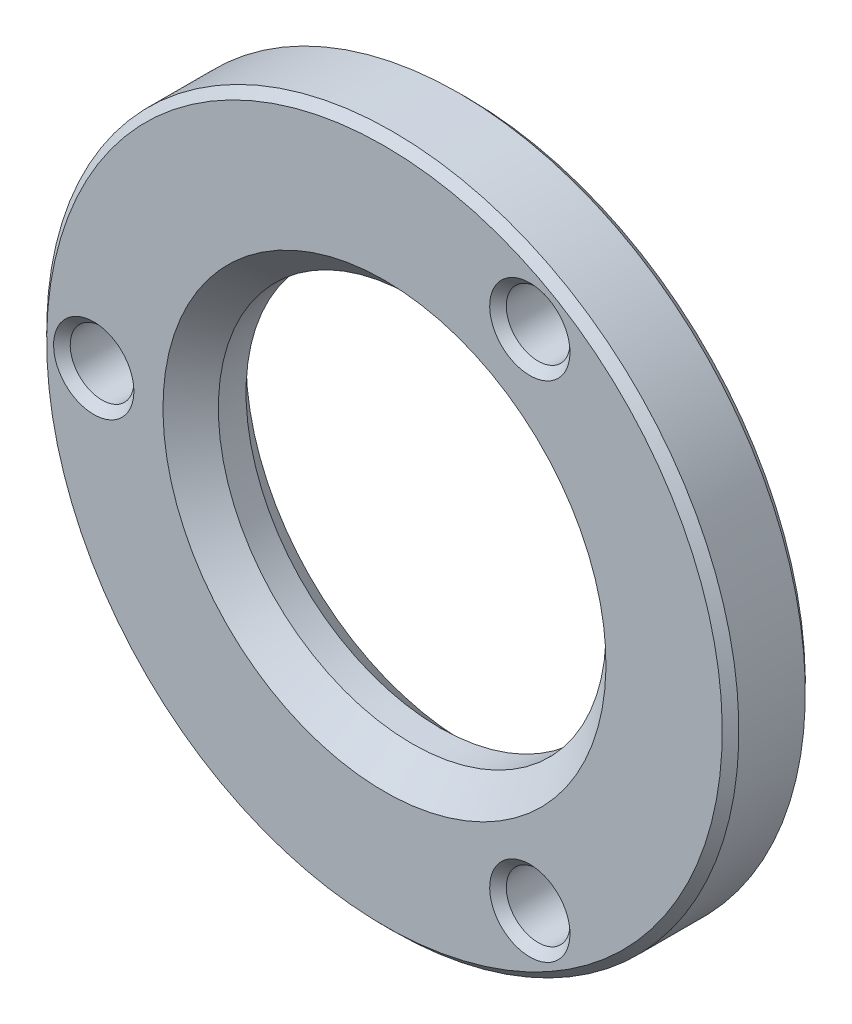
ISO-10303-21;
HEADER;
FILE_DESCRIPTION(('STEP AP214'),'2;1');
FILE_NAME('part.step','',(''),(''),'','','');
FILE_SCHEMA(('AUTOMOTIVE_DESIGN { 1 0 10303 214 1 1 1 1 }'));
ENDSEC;
DATA;
#1=APPLICATION_CONTEXT('core data for automotive mechanical design processes');
#2=APPLICATION_PROTOCOL_DEFINITION('international standard','automotive_design',2000,#1);
#3=PRODUCT_CONTEXT('',#1,'mechanical');
#4=PRODUCT('Part','Part','',(#3));
#5=PRODUCT_RELATED_PRODUCT_CATEGORY('part','',(#4));
#6=PRODUCT_DEFINITION_FORMATION('','',#4);
#7=PRODUCT_DEFINITION_CONTEXT('part definition',#1,'design');
#8=PRODUCT_DEFINITION('design','',#6,#7);
#9=PRODUCT_DEFINITION_SHAPE('','',#8);
#10=(LENGTH_UNIT() NAMED_UNIT(*) SI_UNIT(.MILLI.,.METRE.));
#11=(NAMED_UNIT(*) PLANE_ANGLE_UNIT() SI_UNIT($,.RADIAN.));
#12=(NAMED_UNIT(*) SI_UNIT($,.STERADIAN.) SOLID_ANGLE_UNIT());
#13=UNCERTAINTY_MEASURE_WITH_UNIT(LENGTH_MEASURE(1.E-05),#10,'distance_accuracy_value','');
#14=(GEOMETRIC_REPRESENTATION_CONTEXT(3) GLOBAL_UNCERTAINTY_ASSIGNED_CONTEXT((#13)) GLOBAL_UNIT_ASSIGNED_CONTEXT((#10,
#11,#12)) REPRESENTATION_CONTEXT('',''));
#15=CARTESIAN_POINT('',(0.,0.,0.));
#16=DIRECTION('',(0.,0.,1.));
#17=DIRECTION('',(1.,0.,0.));
#18=AXIS2_PLACEMENT_3D('',#15,#16,#17);
#19=CARTESIAN_POINT('',(0.,0.,3.));
#20=DIRECTION('',(0.,0.,1.));
#21=DIRECTION('',(0.,1.,0.));
#22=AXIS2_PLACEMENT_3D('',#19,#20,#21);
#23=PLANE('',#22);
#24=CARTESIAN_POINT('',(0.,0.,3.));
#25=DIRECTION('',(0.,0.,1.));
#26=DIRECTION('',(0.,1.,0.));
#27=AXIS2_PLACEMENT_3D('',#24,#25,#26);
#28=CIRCLE('',#27,8.);
#29=CARTESIAN_POINT('',(0.,8.,3.));
#30=VERTEX_POINT('',#29);
#31=EDGE_CURVE('E8',#30,#30,#28,.F.);
#32=ORIENTED_EDGE('',*,*,#31,.T.);
#33=EDGE_LOOP('',(#32));
#34=FACE_BOUND('',#33,.T.);
#35=CARTESIAN_POINT('',(5.25,9.09326673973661,3.));
#36=DIRECTION('',(0.,0.,1.));
#37=DIRECTION('',(0.,1.,0.));
#38=AXIS2_PLACEMENT_3D('',#35,#36,#37);
#39=CIRCLE('',#38,1.45);
#40=CARTESIAN_POINT('',(5.25,10.5432667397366,3.));
#41=VERTEX_POINT('',#40);
#42=EDGE_CURVE('E62',#41,#41,#39,.F.);
#43=ORIENTED_EDGE('',*,*,#42,.T.);
#44=EDGE_LOOP('',(#43));
#45=FACE_BOUND('',#44,.T.);
#46=CARTESIAN_POINT('',(-10.5,0.,3.));
#47=DIRECTION('',(0.,0.,1.));
#48=DIRECTION('',(0.,1.,0.));
#49=AXIS2_PLACEMENT_3D('',#46,#47,#48);
#50=CIRCLE('',#49,1.45);
#51=CARTESIAN_POINT('',(-10.5,1.45,3.));
#52=VERTEX_POINT('',#51);
#53=EDGE_CURVE('E65',#52,#52,#50,.F.);
#54=ORIENTED_EDGE('',*,*,#53,.T.);
#55=EDGE_LOOP('',(#54));
#56=FACE_BOUND('',#55,.T.);
#57=CARTESIAN_POINT('',(5.25,-9.0932667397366,3.));
#58=DIRECTION('',(0.,0.,1.));
#59=DIRECTION('',(0.,1.,0.));
#60=AXIS2_PLACEMENT_3D('',#57,#58,#59);
#61=CIRCLE('',#60,1.45);
#62=CARTESIAN_POINT('',(5.25,-7.6432667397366,3.));
#63=VERTEX_POINT('',#62);
#64=EDGE_CURVE('E68',#63,#63,#61,.F.);
#65=ORIENTED_EDGE('',*,*,#64,.T.);
#66=EDGE_LOOP('',(#65));
#67=FACE_BOUND('',#66,.T.);
#68=CARTESIAN_POINT('',(0.,0.,3.));
#69=DIRECTION('',(0.,0.,1.));
#70=DIRECTION('',(0.,1.,0.));
#71=AXIS2_PLACEMENT_3D('',#68,#69,#70);
#72=CIRCLE('',#71,12.2);
#73=CARTESIAN_POINT('',(0.,12.2,3.));
#74=VERTEX_POINT('',#73);
#75=EDGE_CURVE('E71',#74,#74,#72,.T.);
#76=ORIENTED_EDGE('',*,*,#75,.T.);
#77=EDGE_LOOP('',(#76));
#78=FACE_BOUND('',#77,.T.);
#79=ADVANCED_FACE('F12',(#34,#45,#56,#67,#78),#23,.T.);
#80=CARTESIAN_POINT('',(0.,0.,0.));
#81=DIRECTION('',(0.,0.,1.));
#82=DIRECTION('',(0.,1.,0.));
#83=AXIS2_PLACEMENT_3D('',#80,#81,#82);
#84=PLANE('',#83);
#85=CARTESIAN_POINT('',(0.,0.,0.));
#86=DIRECTION('',(0.,0.,1.));
#87=DIRECTION('',(0.,1.,0.));
#88=AXIS2_PLACEMENT_3D('',#85,#86,#87);
#89=CIRCLE('',#88,8.);
#90=CARTESIAN_POINT('',(0.,8.,0.));
#91=VERTEX_POINT('',#90);
#92=EDGE_CURVE('E27',#91,#91,#89,.T.);
#93=ORIENTED_EDGE('',*,*,#92,.T.);
#94=EDGE_LOOP('',(#93));
#95=FACE_BOUND('',#94,.T.);
#96=CARTESIAN_POINT('',(5.25,9.09326673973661,0.));
#97=DIRECTION('',(0.,0.,1.));
#98=DIRECTION('',(0.,1.,0.));
#99=AXIS2_PLACEMENT_3D('',#96,#97,#98);
#100=CIRCLE('',#99,1.45);
#101=CARTESIAN_POINT('',(5.25,10.5432667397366,0.));
#102=VERTEX_POINT('',#101);
#103=EDGE_CURVE('E50',#102,#102,#100,.T.);
#104=ORIENTED_EDGE('',*,*,#103,.T.);
#105=EDGE_LOOP('',(#104));
#106=FACE_BOUND('',#105,.T.);
#107=CARTESIAN_POINT('',(-10.5,0.,0.));
#108=DIRECTION('',(0.,0.,1.));
#109=DIRECTION('',(0.,1.,0.));
#110=AXIS2_PLACEMENT_3D('',#107,#108,#109);
#111=CIRCLE('',#110,1.45);
#112=CARTESIAN_POINT('',(-10.5,1.45,0.));
#113=VERTEX_POINT('',#112);
#114=EDGE_CURVE('E53',#113,#113,#111,.T.);
#115=ORIENTED_EDGE('',*,*,#114,.T.);
#116=EDGE_LOOP('',(#115));
#117=FACE_BOUND('',#116,.T.);
#118=CARTESIAN_POINT('',(5.25,-9.0932667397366,0.));
#119=DIRECTION('',(0.,0.,1.));
#120=DIRECTION('',(0.,1.,0.));
#121=AXIS2_PLACEMENT_3D('',#118,#119,#120);
#122=CIRCLE('',#121,1.45);
#123=CARTESIAN_POINT('',(5.25,-7.6432667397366,0.));
#124=VERTEX_POINT('',#123);
#125=EDGE_CURVE('E56',#124,#124,#122,.T.);
#126=ORIENTED_EDGE('',*,*,#125,.T.);
#127=EDGE_LOOP('',(#126));
#128=FACE_BOUND('',#127,.T.);
#129=CARTESIAN_POINT('',(0.,0.,0.));
#130=DIRECTION('',(0.,0.,1.));
#131=DIRECTION('',(0.,1.,0.));
#132=AXIS2_PLACEMENT_3D('',#129,#130,#131);
#133=CIRCLE('',#132,12.2);
#134=CARTESIAN_POINT('',(0.,12.2,0.));
#135=VERTEX_POINT('',#134);
#136=EDGE_CURVE('E59',#135,#135,#133,.F.);
#137=ORIENTED_EDGE('',*,*,#136,.T.);
#138=EDGE_LOOP('',(#137));
#139=FACE_BOUND('',#138,.T.);
#140=ADVANCED_FACE('F91',(#95,#106,#117,#128,#139),#84,.F.);
#141=CARTESIAN_POINT('',(0.,0.,3.));
#142=DIRECTION('',(0.,0.,-1.));
#143=DIRECTION('',(0.,-1.,0.));
#144=AXIS2_PLACEMENT_3D('',#141,#142,#143);
#145=CYLINDRICAL_SURFACE('',#144,12.5);
#146=CARTESIAN_POINT('',(0.,0.,0.3));
#147=DIRECTION('',(0.,0.,1.));
#148=DIRECTION('',(0.,1.,0.));
#149=AXIS2_PLACEMENT_3D('',#146,#147,#148);
#150=CIRCLE('',#149,12.5);
#151=CARTESIAN_POINT('',(0.,12.5,0.3));
#152=VERTEX_POINT('',#151);
#153=EDGE_CURVE('E32',#152,#152,#150,.T.);
#154=ORIENTED_EDGE('',*,*,#153,.T.);
#155=EDGE_LOOP('',(#154));
#156=FACE_BOUND('',#155,.T.);
#157=CARTESIAN_POINT('',(0.,0.,2.7));
#158=DIRECTION('',(0.,0.,1.));
#159=DIRECTION('',(0.,1.,0.));
#160=AXIS2_PLACEMENT_3D('',#157,#158,#159);
#161=CIRCLE('',#160,12.5);
#162=CARTESIAN_POINT('',(0.,12.5,2.7));
#163=VERTEX_POINT('',#162);
#164=EDGE_CURVE('E35',#163,#163,#161,.F.);
#165=ORIENTED_EDGE('',*,*,#164,.T.);
#166=EDGE_LOOP('',(#165));
#167=FACE_BOUND('',#166,.T.);
#168=ADVANCED_FACE('F94',(#156,#167),#145,.T.);
#169=CARTESIAN_POINT('',(0.,0.,3.));
#170=DIRECTION('',(0.,0.,-1.));
#171=DIRECTION('',(0.,-1.,0.));
#172=AXIS2_PLACEMENT_3D('',#169,#170,#171);
#173=CYLINDRICAL_SURFACE('',#172,7.);
#174=CARTESIAN_POINT('',(0.,0.,1.));
#175=DIRECTION('',(0.,0.,1.));
#176=DIRECTION('',(0.,1.,0.));
#177=AXIS2_PLACEMENT_3D('',#174,#175,#176);
#178=CIRCLE('',#177,7.);
#179=CARTESIAN_POINT('',(0.,7.,1.));
#180=VERTEX_POINT('',#179);
#181=EDGE_CURVE('E19',#180,#180,#178,.F.);
#182=ORIENTED_EDGE('',*,*,#181,.T.);
#183=EDGE_LOOP('',(#182));
#184=FACE_BOUND('',#183,.T.);
#185=CARTESIAN_POINT('',(0.,0.,2.));
#186=DIRECTION('',(0.,0.,1.));
#187=DIRECTION('',(0.,1.,0.));
#188=AXIS2_PLACEMENT_3D('',#185,#186,#187);
#189=CIRCLE('',#188,7.);
#190=CARTESIAN_POINT('',(0.,7.,2.));
#191=VERTEX_POINT('',#190);
#192=EDGE_CURVE('E23',#191,#191,#189,.T.);
#193=ORIENTED_EDGE('',*,*,#192,.T.);
#194=EDGE_LOOP('',(#193));
#195=FACE_BOUND('',#194,.T.);
#196=ADVANCED_FACE('F113',(#184,#195),#173,.F.);
#197=CARTESIAN_POINT('',(-10.5,0.,0.));
#198=DIRECTION('',(0.,0.,1.));
#199=DIRECTION('',(0.,1.,0.));
#200=AXIS2_PLACEMENT_3D('',#197,#198,#199);
#201=CYLINDRICAL_SURFACE('',#200,1.15);
#202=CARTESIAN_POINT('',(-10.5,0.,2.7));
#203=DIRECTION('',(0.,0.,1.));
#204=DIRECTION('',(0.,1.,0.));
#205=AXIS2_PLACEMENT_3D('',#202,#203,#204);
#206=CIRCLE('',#205,1.15);
#207=CARTESIAN_POINT('',(-10.5,1.15,2.7));
#208=VERTEX_POINT('',#207);
#209=EDGE_CURVE('E44',#208,#208,#206,.T.);
#210=ORIENTED_EDGE('',*,*,#209,.T.);
#211=EDGE_LOOP('',(#210));
#212=FACE_BOUND('',#211,.T.);
#213=CARTESIAN_POINT('',(-10.5,0.,0.3));
#214=DIRECTION('',(0.,0.,1.));
#215=DIRECTION('',(0.,1.,0.));
#216=AXIS2_PLACEMENT_3D('',#213,#214,#215);
#217=CIRCLE('',#216,1.15);
#218=CARTESIAN_POINT('',(-10.5,1.15,0.3));
#219=VERTEX_POINT('',#218);
#220=EDGE_CURVE('E47',#219,#219,#217,.F.);
#221=ORIENTED_EDGE('',*,*,#220,.T.);
#222=EDGE_LOOP('',(#221));
#223=FACE_BOUND('',#222,.T.);
#224=ADVANCED_FACE('F162',(#212,#223),#201,.F.);
#225=CARTESIAN_POINT('',(5.25,-9.0932667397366,0.));
#226=DIRECTION('',(0.,0.,1.));
#227=DIRECTION('',(0.,1.,0.));
#228=AXIS2_PLACEMENT_3D('',#225,#226,#227);
#229=CYLINDRICAL_SURFACE('',#228,1.15);
#230=CARTESIAN_POINT('',(5.25,-9.0932667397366,2.7));
#231=DIRECTION('',(0.,0.,1.));
#232=DIRECTION('',(0.,1.,0.));
#233=AXIS2_PLACEMENT_3D('',#230,#231,#232);
#234=CIRCLE('',#233,1.15);
#235=CARTESIAN_POINT('',(5.25,-7.9432667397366,2.7));
#236=VERTEX_POINT('',#235);
#237=EDGE_CURVE('E38',#236,#236,#234,.T.);
#238=ORIENTED_EDGE('',*,*,#237,.T.);
#239=EDGE_LOOP('',(#238));
#240=FACE_BOUND('',#239,.T.);
#241=CARTESIAN_POINT('',(5.25,-9.0932667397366,0.3));
#242=DIRECTION('',(0.,0.,1.));
#243=DIRECTION('',(0.,1.,0.));
#244=AXIS2_PLACEMENT_3D('',#241,#242,#243);
#245=CIRCLE('',#244,1.15);
#246=CARTESIAN_POINT('',(5.25,-7.9432667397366,0.3));
#247=VERTEX_POINT('',#246);
#248=EDGE_CURVE('E41',#247,#247,#245,.F.);
#249=ORIENTED_EDGE('',*,*,#248,.T.);
#250=EDGE_LOOP('',(#249));
#251=FACE_BOUND('',#250,.T.);
#252=ADVANCED_FACE('F166',(#240,#251),#229,.F.);
#253=CARTESIAN_POINT('',(5.25,9.09326673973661,0.));
#254=DIRECTION('',(0.,0.,1.));
#255=DIRECTION('',(0.,1.,0.));
#256=AXIS2_PLACEMENT_3D('',#253,#254,#255);
#257=CYLINDRICAL_SURFACE('',#256,1.15);
#258=CARTESIAN_POINT('',(5.25,9.09326673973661,2.7));
#259=DIRECTION('',(0.,0.,1.));
#260=DIRECTION('',(0.,1.,0.));
#261=AXIS2_PLACEMENT_3D('',#258,#259,#260);
#262=CIRCLE('',#261,1.15);
#263=CARTESIAN_POINT('',(5.25,10.2432667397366,2.7));
#264=VERTEX_POINT('',#263);
#265=EDGE_CURVE('E74',#264,#264,#262,.T.);
#266=ORIENTED_EDGE('',*,*,#265,.T.);
#267=EDGE_LOOP('',(#266));
#268=FACE_BOUND('',#267,.T.);
#269=CARTESIAN_POINT('',(5.25,9.09326673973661,0.3));
#270=DIRECTION('',(0.,0.,1.));
#271=DIRECTION('',(0.,1.,0.));
#272=AXIS2_PLACEMENT_3D('',#269,#270,#271);
#273=CIRCLE('',#272,1.15);
#274=CARTESIAN_POINT('',(5.25,10.2432667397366,0.3));
#275=VERTEX_POINT('',#274);
#276=EDGE_CURVE('E77',#275,#275,#273,.F.);
#277=ORIENTED_EDGE('',*,*,#276,.T.);
#278=EDGE_LOOP('',(#277));
#279=FACE_BOUND('',#278,.T.);
#280=ADVANCED_FACE('F81',(#268,#279),#257,.F.);
#281=CARTESIAN_POINT('',(5.25,9.09326673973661,2.7));
#282=DIRECTION('',(0.,0.,1.));
#283=DIRECTION('',(0.,1.,0.));
#284=AXIS2_PLACEMENT_3D('',#281,#282,#283);
#285=CONICAL_SURFACE('',#284,1.15,0.78539816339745);
#286=ORIENTED_EDGE('',*,*,#42,.F.);
#287=EDGE_LOOP('',(#286));
#288=FACE_BOUND('',#287,.T.);
#289=ORIENTED_EDGE('',*,*,#265,.F.);
#290=EDGE_LOOP('',(#289));
#291=FACE_BOUND('',#290,.T.);
#292=ADVANCED_FACE('F87',(#288,#291),#285,.F.);
#293=CARTESIAN_POINT('',(5.25,9.09326673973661,0.));
#294=DIRECTION('',(0.,0.,-1.));
#295=DIRECTION('',(0.,-1.,0.));
#296=AXIS2_PLACEMENT_3D('',#293,#294,#295);
#297=CONICAL_SURFACE('',#296,1.45,0.785398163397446);
#298=ORIENTED_EDGE('',*,*,#276,.F.);
#299=EDGE_LOOP('',(#298));
#300=FACE_BOUND('',#299,.T.);
#301=ORIENTED_EDGE('',*,*,#103,.F.);
#302=EDGE_LOOP('',(#301));
#303=FACE_BOUND('',#302,.T.);
#304=ADVANCED_FACE('F83',(#300,#303),#297,.F.);
#305=CARTESIAN_POINT('',(-10.5,0.,2.7));
#306=DIRECTION('',(0.,0.,1.));
#307=DIRECTION('',(0.,1.,0.));
#308=AXIS2_PLACEMENT_3D('',#305,#306,#307);
#309=CONICAL_SURFACE('',#308,1.15,0.78539816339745);
#310=ORIENTED_EDGE('',*,*,#53,.F.);
#311=EDGE_LOOP('',(#310));
#312=FACE_BOUND('',#311,.T.);
#313=ORIENTED_EDGE('',*,*,#209,.F.);
#314=EDGE_LOOP('',(#313));
#315=FACE_BOUND('',#314,.T.);
#316=ADVANCED_FACE('F86',(#312,#315),#309,.F.);
#317=CARTESIAN_POINT('',(-10.5,0.,0.));
#318=DIRECTION('',(0.,0.,-1.));
#319=DIRECTION('',(0.,-1.,0.));
#320=AXIS2_PLACEMENT_3D('',#317,#318,#319);
#321=CONICAL_SURFACE('',#320,1.45,0.78539816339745);
#322=ORIENTED_EDGE('',*,*,#220,.F.);
#323=EDGE_LOOP('',(#322));
#324=FACE_BOUND('',#323,.T.);
#325=ORIENTED_EDGE('',*,*,#114,.F.);
#326=EDGE_LOOP('',(#325));
#327=FACE_BOUND('',#326,.T.);
#328=ADVANCED_FACE('F137',(#324,#327),#321,.F.);
#329=CARTESIAN_POINT('',(5.25,-9.0932667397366,2.7));
#330=DIRECTION('',(0.,0.,1.));
#331=DIRECTION('',(0.,1.,0.));
#332=AXIS2_PLACEMENT_3D('',#329,#330,#331);
#333=CONICAL_SURFACE('',#332,1.15,0.78539816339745);
#334=ORIENTED_EDGE('',*,*,#64,.F.);
#335=EDGE_LOOP('',(#334));
#336=FACE_BOUND('',#335,.T.);
#337=ORIENTED_EDGE('',*,*,#237,.F.);
#338=EDGE_LOOP('',(#337));
#339=FACE_BOUND('',#338,.T.);
#340=ADVANCED_FACE('F141',(#336,#339),#333,.F.);
#341=CARTESIAN_POINT('',(5.25,-9.0932667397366,0.));
#342=DIRECTION('',(0.,0.,-1.));
#343=DIRECTION('',(0.,-1.,0.));
#344=AXIS2_PLACEMENT_3D('',#341,#342,#343);
#345=CONICAL_SURFACE('',#344,1.45,0.785398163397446);
#346=ORIENTED_EDGE('',*,*,#248,.F.);
#347=EDGE_LOOP('',(#346));
#348=FACE_BOUND('',#347,.T.);
#349=ORIENTED_EDGE('',*,*,#125,.F.);
#350=EDGE_LOOP('',(#349));
#351=FACE_BOUND('',#350,.T.);
#352=ADVANCED_FACE('F107',(#348,#351),#345,.F.);
#353=CARTESIAN_POINT('',(0.,0.,0.3));
#354=DIRECTION('',(0.,0.,1.));
#355=DIRECTION('',(0.,1.,0.));
#356=AXIS2_PLACEMENT_3D('',#353,#354,#355);
#357=CONICAL_SURFACE('',#356,12.5,0.785398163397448);
#358=ORIENTED_EDGE('',*,*,#136,.F.);
#359=EDGE_LOOP('',(#358));
#360=FACE_BOUND('',#359,.T.);
#361=ORIENTED_EDGE('',*,*,#153,.F.);
#362=EDGE_LOOP('',(#361));
#363=FACE_BOUND('',#362,.T.);
#364=ADVANCED_FACE('F103',(#360,#363),#357,.T.);
#365=CARTESIAN_POINT('',(0.,0.,3.));
#366=DIRECTION('',(0.,0.,-1.));
#367=DIRECTION('',(0.,-1.,0.));
#368=AXIS2_PLACEMENT_3D('',#365,#366,#367);
#369=CONICAL_SURFACE('',#368,12.2,0.785398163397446);
#370=ORIENTED_EDGE('',*,*,#164,.F.);
#371=EDGE_LOOP('',(#370));
#372=FACE_BOUND('',#371,.T.);
#373=ORIENTED_EDGE('',*,*,#75,.F.);
#374=EDGE_LOOP('',(#373));
#375=FACE_BOUND('',#374,.T.);
#376=ADVANCED_FACE('F106',(#372,#375),#369,.T.);
#377=CARTESIAN_POINT('',(0.,0.,0.));
#378=DIRECTION('',(0.,0.,-1.));
#379=DIRECTION('',(0.,-1.,0.));
#380=AXIS2_PLACEMENT_3D('',#377,#378,#379);
#381=CONICAL_SURFACE('',#380,8.,0.785398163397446);
#382=ORIENTED_EDGE('',*,*,#181,.F.);
#383=EDGE_LOOP('',(#382));
#384=FACE_BOUND('',#383,.T.);
#385=ORIENTED_EDGE('',*,*,#92,.F.);
#386=EDGE_LOOP('',(#385));
#387=FACE_BOUND('',#386,.T.);
#388=ADVANCED_FACE('F119',(#384,#387),#381,.F.);
#389=CARTESIAN_POINT('',(0.,0.,2.));
#390=DIRECTION('',(0.,0.,1.));
#391=DIRECTION('',(0.,1.,0.));
#392=AXIS2_PLACEMENT_3D('',#389,#390,#391);
#393=CONICAL_SURFACE('',#392,7.,0.785398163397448);
#394=ORIENTED_EDGE('',*,*,#31,.F.);
#395=EDGE_LOOP('',(#394));
#396=FACE_BOUND('',#395,.T.);
#397=ORIENTED_EDGE('',*,*,#192,.F.);
#398=EDGE_LOOP('',(#397));
#399=FACE_BOUND('',#398,.T.);
#400=ADVANCED_FACE('F14',(#396,#399),#393,.F.);
#401=CLOSED_SHELL('',(#79,#140,#168,#196,#224,#252,#280,#292,#304,#316,#328,#340,#352,#364,#376,
#388,#400));
#402=MANIFOLD_SOLID_BREP('B1',#401);
#403=ADVANCED_BREP_SHAPE_REPRESENTATION('',(#18,#402),#14);
#404=SHAPE_DEFINITION_REPRESENTATION(#9,#403);
ENDSEC;
END-ISO-10303-21;
